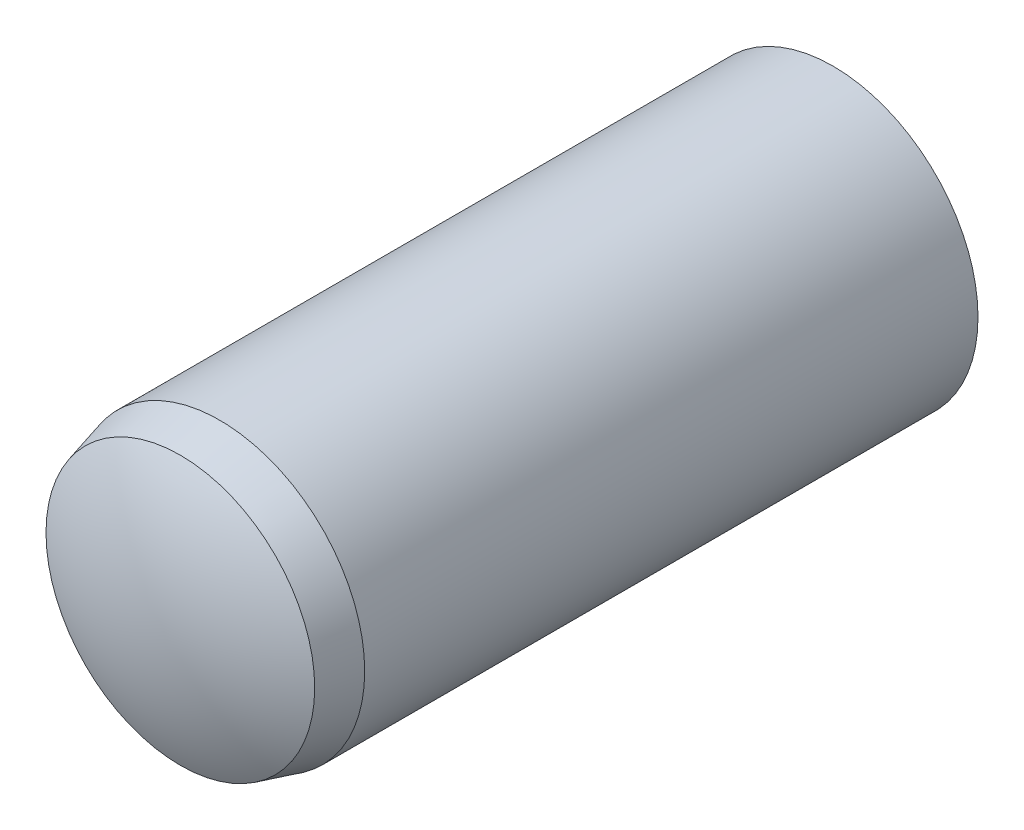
from build123d import *


with BuildPart() as part:
    # Sketch1 → Revolve1 (revolve)
    with BuildSketch(Plane(origin=(0, 0, 0), x_dir=(0, 0, -1), z_dir=(1, 0, 0))):
        with BuildLine():
            Line((-10, 0), (0, 0))
            ThreePointArc((0, 0), (-0.136296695, 1.03527618), (-0.535898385, 2))
            Line((-0.535898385, 2), (-9, 2))
            Line((-9, 2), (-9.544307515, 1.854153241))
            ThreePointArc((-9.544307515, 1.854153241), (-9.884406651, 0.954664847), (-10, 0))
        make_face()
    revolve(axis=Axis((0, 0, 0), (0, 0, -1)))


solid = part.part
